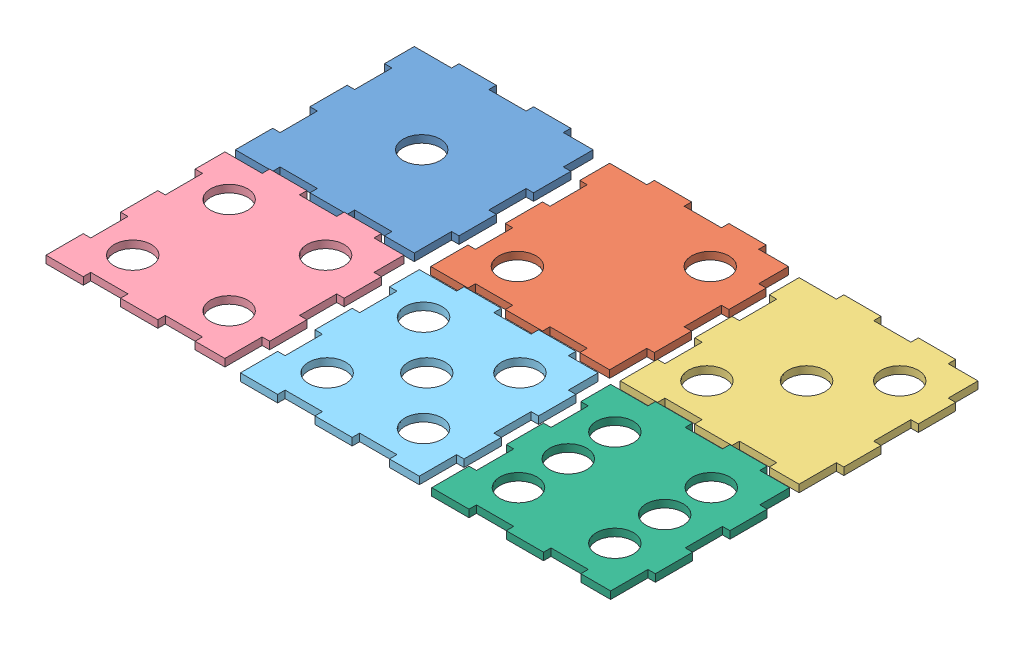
SolidWorks assembly Dice.SLDASM, configuration Default (file format 9000). Lengths in mm.
Overall size (307.7 10 202.5).
6 component instances, 6 part files, 0 mates.
Components (placement in the parent):
- Dice1-3: Dice1.SLDPRT [Default] at (-47.648 100 0.0665) size (100 4 100)
- Dice2-4: Dice2.SLDPRT [Default] at (57.0057 98 -0.099) size (100 4 100)
- Dice3-4: Dice3.SLDPRT [Default] at (159.01 96 0.2321) size (100 4 100)
- Dice4-4: Dice4.SLDPRT [Default] at (-47.4776 102 101.85) size (100 4 100)
- Dice5-3: Dice5.SLDPRT [Default] at (57.3809 100 102.3976) size (100 4 100)
- Dice6-3: Dice6.SLDPRT [Default] at (160.0491 98 102.3976) size (100 4 100)
